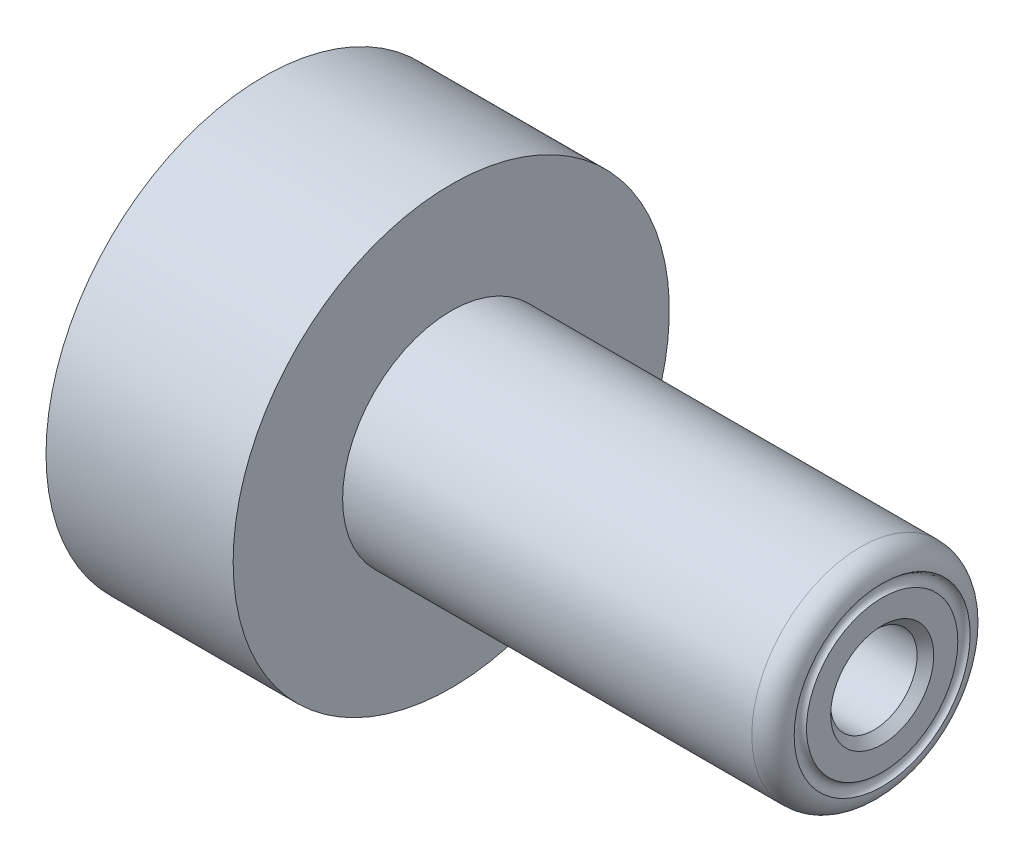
from build123d import *

# Parameters (mm, degrees)
SKETCH2_R          = 1.6129
CUT_EXTRUDE1_DEPTH = 6.35
SKETCH3_R          = 2.515
CUT_EXTRUDE2_DEPTH = 41.224242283
CHAMFER1_SIZE      = 0.485
SKETCH4_R          = 0.381


with BuildPart() as part:
    # Sketch1 → Revolve1 (revolve)
    with BuildSketch(Plane.XY, mode=Mode.PRIVATE) as revolve1_sk:
        with BuildLine():
            Line((0, 3.9751), (0, 12.7))
            Line((0, 12.7), (10.8966, 12.7))
            Line((10.8966, 12.7), (10.8966, 6.3246))
            Line((10.8966, 6.3246), (34.7218, 6.3246))
            ThreePointArc((34.7218, 6.3246), (35.619825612, 5.952625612), (35.9918, 5.0546))
            Line((35.9918, 5.0546), (35.9918, 0))
            Line((35.9918, 0), (21.8948, 0))
            Line((21.8948, 0), (21.8948, 3.9751))
            Line((21.8948, 3.9751), (0, 3.9751))
        make_face()
    revolve(revolve1_sk.sketch.rotate(Axis((0, 0, 0), (1, 0, 0)), 90), axis=Axis((0, 0, 0), (1, 0, 0)))

    # Sketch2 → Cut-Extrude1 (cut)
    with BuildSketch(Plane.ZY):
        with Locations((-7.1374, 0)):
            Circle(SKETCH2_R)
        with Locations(Location((7.1374, 0, 0), (0, 0, 180))):
            Circle(SKETCH2_R)
    extrude(amount=-CUT_EXTRUDE1_DEPTH, mode=Mode.SUBTRACT)

    # Sketch3 → Cut-Extrude2 (cut, through all)
    with BuildSketch(Plane(origin=(35.9918, 0, 0), x_dir=(0, 0, -1), z_dir=(1, 0, 0))):
        Circle(SKETCH3_R)
    extrude(amount=-CUT_EXTRUDE2_DEPTH, mode=Mode.SUBTRACT)

    # Chamfer1
    chamfer1_edges = [part.edges().sort_by_distance(p)[0] for p in [
        (35.9918, 0, 2.515),
    ]]
    chamfer(chamfer1_edges, length=CHAMFER1_SIZE)

    # Sketch4 → Cut-Revolve1 (revolve, cut)
    with BuildSketch(Plane.XY, mode=Mode.PRIVATE) as cut_revolve1_sk:
        with Locations((36.117, 4.765)):
            Circle(SKETCH4_R)
    revolve(cut_revolve1_sk.sketch.rotate(Axis((0, 0, 0), (1, 0, 0)), 90), axis=Axis((0, 0, 0), (1, 0, 0)), mode=Mode.SUBTRACT)


solid = part.part
